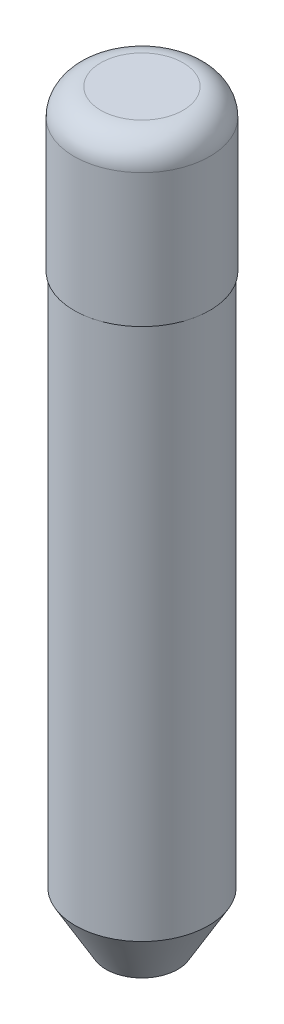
ISO-10303-21;
HEADER;
FILE_DESCRIPTION(('STEP AP214'),'2;1');
FILE_NAME('part.step','',(''),(''),'','','');
FILE_SCHEMA(('AUTOMOTIVE_DESIGN { 1 0 10303 214 1 1 1 1 }'));
ENDSEC;
DATA;
#1=APPLICATION_CONTEXT('core data for automotive mechanical design processes');
#2=APPLICATION_PROTOCOL_DEFINITION('international standard','automotive_design',2000,#1);
#3=PRODUCT_CONTEXT('',#1,'mechanical');
#4=PRODUCT('Part','Part','',(#3));
#5=PRODUCT_RELATED_PRODUCT_CATEGORY('part','',(#4));
#6=PRODUCT_DEFINITION_FORMATION('','',#4);
#7=PRODUCT_DEFINITION_CONTEXT('part definition',#1,'design');
#8=PRODUCT_DEFINITION('design','',#6,#7);
#9=PRODUCT_DEFINITION_SHAPE('','',#8);
#10=(LENGTH_UNIT() NAMED_UNIT(*) SI_UNIT(.MILLI.,.METRE.));
#11=(NAMED_UNIT(*) PLANE_ANGLE_UNIT() SI_UNIT($,.RADIAN.));
#12=(NAMED_UNIT(*) SI_UNIT($,.STERADIAN.) SOLID_ANGLE_UNIT());
#13=UNCERTAINTY_MEASURE_WITH_UNIT(LENGTH_MEASURE(1.E-05),#10,'distance_accuracy_value','');
#14=(GEOMETRIC_REPRESENTATION_CONTEXT(3) GLOBAL_UNCERTAINTY_ASSIGNED_CONTEXT((#13)) GLOBAL_UNIT_ASSIGNED_CONTEXT((#10,
#11,#12)) REPRESENTATION_CONTEXT('',''));
#15=CARTESIAN_POINT('',(0.,0.,0.));
#16=DIRECTION('',(0.,0.,1.));
#17=DIRECTION('',(1.,0.,0.));
#18=AXIS2_PLACEMENT_3D('',#15,#16,#17);
#19=CARTESIAN_POINT('',(-0.854265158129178,-8.89,0.));
#20=DIRECTION('',(0.,-1.,0.));
#21=DIRECTION('',(0.,0.,-1.));
#22=AXIS2_PLACEMENT_3D('',#19,#20,#21);
#23=PLANE('',#22);
#24=CARTESIAN_POINT('',(0.,-8.89,0.));
#25=DIRECTION('',(0.,1.,0.));
#26=DIRECTION('',(0.,0.,1.));
#27=AXIS2_PLACEMENT_3D('',#24,#25,#26);
#28=CIRCLE('',#27,0.854265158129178);
#29=CARTESIAN_POINT('',(0.,-8.89,0.854265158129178));
#30=VERTEX_POINT('',#29);
#31=EDGE_CURVE('E41',#30,#30,#28,.T.);
#32=ORIENTED_EDGE('',*,*,#31,.F.);
#33=EDGE_LOOP('',(#32));
#34=FACE_BOUND('',#33,.T.);
#35=ADVANCED_FACE('F30',(#34),#23,.T.);
#36=CARTESIAN_POINT('',(0.,-7.62,0.));
#37=DIRECTION('',(0.,1.,0.));
#38=DIRECTION('',(0.,0.,1.));
#39=AXIS2_PLACEMENT_3D('',#36,#37,#38);
#40=CONICAL_SURFACE('',#39,1.5875,0.523598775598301);
#41=ORIENTED_EDGE('',*,*,#31,.T.);
#42=EDGE_LOOP('',(#41));
#43=FACE_BOUND('',#42,.T.);
#44=CARTESIAN_POINT('',(0.,-7.62,0.));
#45=DIRECTION('',(0.,1.,0.));
#46=DIRECTION('',(0.,0.,1.));
#47=AXIS2_PLACEMENT_3D('',#44,#45,#46);
#48=CIRCLE('',#47,1.5875);
#49=CARTESIAN_POINT('',(0.,-7.62,1.5875));
#50=VERTEX_POINT('',#49);
#51=EDGE_CURVE('E45',#50,#50,#48,.T.);
#52=ORIENTED_EDGE('',*,*,#51,.F.);
#53=EDGE_LOOP('',(#52));
#54=FACE_BOUND('',#53,.T.);
#55=ADVANCED_FACE('F70',(#43,#54),#40,.T.);
#56=CARTESIAN_POINT('',(0.,39.0068297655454,0.));
#57=DIRECTION('',(0.,1.,0.));
#58=DIRECTION('',(0.,0.,1.));
#59=AXIS2_PLACEMENT_3D('',#56,#57,#58);
#60=CYLINDRICAL_SURFACE('',#59,1.5875);
#61=ORIENTED_EDGE('',*,*,#51,.T.);
#62=EDGE_LOOP('',(#61));
#63=FACE_BOUND('',#62,.T.);
#64=CARTESIAN_POINT('',(0.,5.08,0.));
#65=DIRECTION('',(0.,1.,0.));
#66=DIRECTION('',(0.,0.,1.));
#67=AXIS2_PLACEMENT_3D('',#64,#65,#66);
#68=CIRCLE('',#67,1.5875);
#69=CARTESIAN_POINT('',(0.,5.08,1.5875));
#70=VERTEX_POINT('',#69);
#71=EDGE_CURVE('E50',#70,#70,#68,.T.);
#72=ORIENTED_EDGE('',*,*,#71,.F.);
#73=EDGE_LOOP('',(#72));
#74=FACE_BOUND('',#73,.T.);
#75=ADVANCED_FACE('F61',(#63,#74),#60,.T.);
#76=CARTESIAN_POINT('',(-1.61544,5.08,0.));
#77=DIRECTION('',(0.,-1.,0.));
#78=DIRECTION('',(0.,0.,-1.));
#79=AXIS2_PLACEMENT_3D('',#76,#77,#78);
#80=PLANE('',#79);
#81=ORIENTED_EDGE('',*,*,#71,.T.);
#82=EDGE_LOOP('',(#81));
#83=FACE_BOUND('',#82,.T.);
#84=CARTESIAN_POINT('',(0.,5.08,0.));
#85=DIRECTION('',(0.,1.,0.));
#86=DIRECTION('',(0.,0.,1.));
#87=AXIS2_PLACEMENT_3D('',#84,#85,#86);
#88=CIRCLE('',#87,1.61544);
#89=CARTESIAN_POINT('',(0.,5.08,1.61544));
#90=VERTEX_POINT('',#89);
#91=EDGE_CURVE('E53',#90,#90,#88,.T.);
#92=ORIENTED_EDGE('',*,*,#91,.F.);
#93=EDGE_LOOP('',(#92));
#94=FACE_BOUND('',#93,.T.);
#95=ADVANCED_FACE('F59',(#83,#94),#80,.T.);
#96=CARTESIAN_POINT('',(0.,39.0068297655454,0.));
#97=DIRECTION('',(0.,1.,0.));
#98=DIRECTION('',(0.,0.,1.));
#99=AXIS2_PLACEMENT_3D('',#96,#97,#98);
#100=CYLINDRICAL_SURFACE('',#99,1.61544);
#101=CARTESIAN_POINT('',(0.,8.255,0.));
#102=DIRECTION('',(0.,1.,0.));
#103=DIRECTION('',(0.,0.,1.));
#104=AXIS2_PLACEMENT_3D('',#101,#102,#103);
#105=CIRCLE('',#104,1.61544);
#106=CARTESIAN_POINT('',(0.,8.255,1.61544));
#107=VERTEX_POINT('',#106);
#108=EDGE_CURVE('E10',#107,#107,#105,.F.);
#109=ORIENTED_EDGE('',*,*,#108,.T.);
#110=EDGE_LOOP('',(#109));
#111=FACE_BOUND('',#110,.T.);
#112=ORIENTED_EDGE('',*,*,#91,.T.);
#113=EDGE_LOOP('',(#112));
#114=FACE_BOUND('',#113,.T.);
#115=ADVANCED_FACE('F57',(#111,#114),#100,.T.);
#116=CARTESIAN_POINT('',(0.,8.89,0.));
#117=DIRECTION('',(0.,1.,0.));
#118=DIRECTION('',(0.,0.,1.));
#119=AXIS2_PLACEMENT_3D('',#116,#117,#118);
#120=PLANE('',#119);
#121=CARTESIAN_POINT('',(0.,8.89,0.));
#122=DIRECTION('',(0.,1.,0.));
#123=DIRECTION('',(0.,0.,1.));
#124=AXIS2_PLACEMENT_3D('',#121,#122,#123);
#125=CIRCLE('',#124,0.980439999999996);
#126=CARTESIAN_POINT('',(0.,8.89,0.980439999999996));
#127=VERTEX_POINT('',#126);
#128=EDGE_CURVE('E37',#127,#127,#125,.T.);
#129=ORIENTED_EDGE('',*,*,#128,.T.);
#130=EDGE_LOOP('',(#129));
#131=FACE_BOUND('',#130,.T.);
#132=ADVANCED_FACE('F68',(#131),#120,.T.);
#133=CARTESIAN_POINT('',(0.,8.255,0.));
#134=DIRECTION('',(0.,1.,0.));
#135=DIRECTION('',(0.,0.,1.));
#136=AXIS2_PLACEMENT_3D('',#133,#134,#135);
#137=TOROIDAL_SURFACE('',#136,0.980439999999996,0.635);
#138=ORIENTED_EDGE('',*,*,#108,.F.);
#139=EDGE_LOOP('',(#138));
#140=FACE_BOUND('',#139,.T.);
#141=ORIENTED_EDGE('',*,*,#128,.F.);
#142=EDGE_LOOP('',(#141));
#143=FACE_BOUND('',#142,.T.);
#144=ADVANCED_FACE('F32',(#140,#143),#137,.T.);
#145=CLOSED_SHELL('',(#35,#55,#75,#95,#115,#132,#144));
#146=MANIFOLD_SOLID_BREP('B2',#145);
#147=ADVANCED_BREP_SHAPE_REPRESENTATION('',(#18,#146),#14);
#148=SHAPE_DEFINITION_REPRESENTATION(#9,#147);
ENDSEC;
END-ISO-10303-21;
